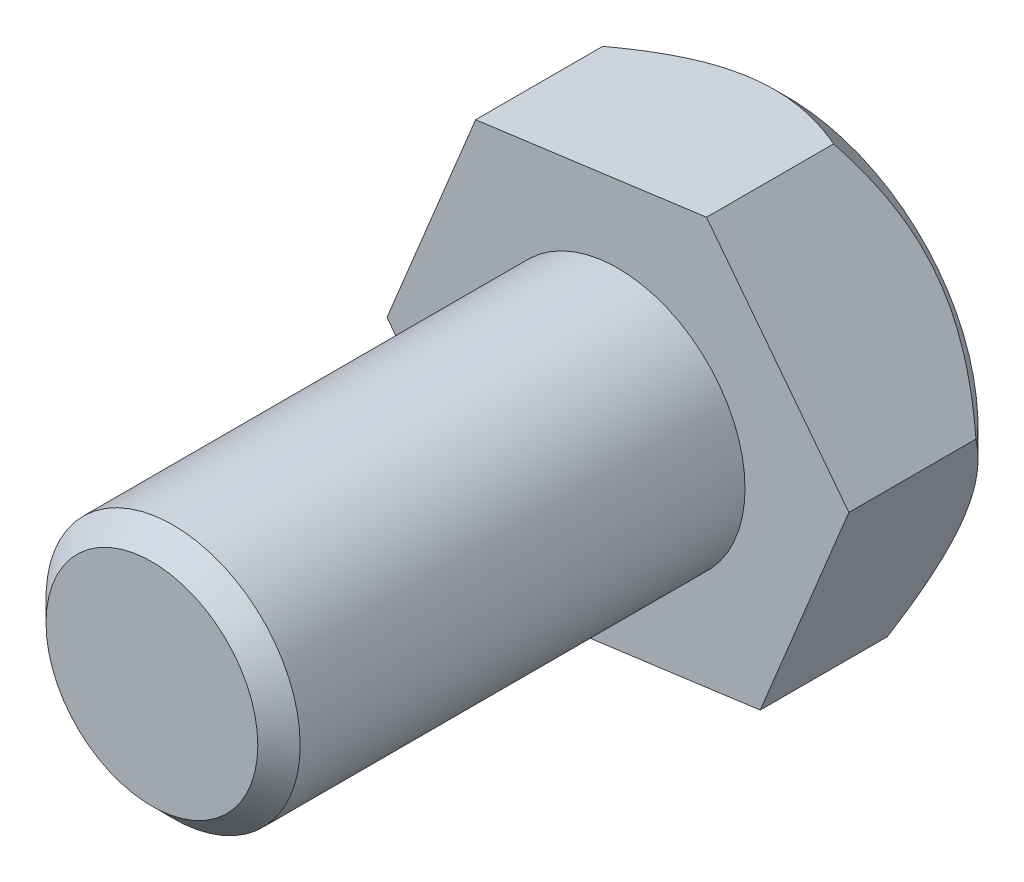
ISO-10303-21;
HEADER;
FILE_DESCRIPTION(('STEP AP214'),'2;1');
FILE_NAME('part.step','',(''),(''),'','','');
FILE_SCHEMA(('AUTOMOTIVE_DESIGN { 1 0 10303 214 1 1 1 1 }'));
ENDSEC;
DATA;
#1=APPLICATION_CONTEXT('core data for automotive mechanical design processes');
#2=APPLICATION_PROTOCOL_DEFINITION('international standard','automotive_design',2000,#1);
#3=PRODUCT_CONTEXT('',#1,'mechanical');
#4=PRODUCT('Part','Part','',(#3));
#5=PRODUCT_RELATED_PRODUCT_CATEGORY('part','',(#4));
#6=PRODUCT_DEFINITION_FORMATION('','',#4);
#7=PRODUCT_DEFINITION_CONTEXT('part definition',#1,'design');
#8=PRODUCT_DEFINITION('design','',#6,#7);
#9=PRODUCT_DEFINITION_SHAPE('','',#8);
#10=(LENGTH_UNIT() NAMED_UNIT(*) SI_UNIT(.MILLI.,.METRE.));
#11=(NAMED_UNIT(*) PLANE_ANGLE_UNIT() SI_UNIT($,.RADIAN.));
#12=(NAMED_UNIT(*) SI_UNIT($,.STERADIAN.) SOLID_ANGLE_UNIT());
#13=UNCERTAINTY_MEASURE_WITH_UNIT(LENGTH_MEASURE(1.E-05),#10,'distance_accuracy_value','');
#14=(GEOMETRIC_REPRESENTATION_CONTEXT(3) GLOBAL_UNCERTAINTY_ASSIGNED_CONTEXT((#13)) GLOBAL_UNIT_ASSIGNED_CONTEXT((#10,
#11,#12)) REPRESENTATION_CONTEXT('',''));
#15=CARTESIAN_POINT('',(0.,0.,0.));
#16=DIRECTION('',(0.,0.,1.));
#17=DIRECTION('',(1.,0.,0.));
#18=AXIS2_PLACEMENT_3D('',#15,#16,#17);
#19=CARTESIAN_POINT('',(0.,0.,0.));
#20=DIRECTION('',(0.,0.,1.));
#21=DIRECTION('',(1.,0.,0.));
#22=AXIS2_PLACEMENT_3D('',#19,#20,#21);
#23=PLANE('',#22);
#24=CARTESIAN_POINT('',(0.,0.,0.));
#25=DIRECTION('',(0.,0.,1.));
#26=DIRECTION('',(1.,0.,0.));
#27=AXIS2_PLACEMENT_3D('',#24,#25,#26);
#28=CIRCLE('',#27,4.5);
#29=CARTESIAN_POINT('',(1.7113581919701,4.16188096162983,0.));
#30=VERTEX_POINT('',#29);
#31=EDGE_CURVE('E46',#30,#30,#28,.F.);
#32=ORIENTED_EDGE('',*,*,#31,.T.);
#33=EDGE_LOOP('',(#32));
#34=FACE_BOUND('',#33,.T.);
#35=ADVANCED_FACE('F33',(#34),#23,.F.);
#36=CARTESIAN_POINT('',(0.,0.,4.));
#37=DIRECTION('',(0.,0.,1.));
#38=DIRECTION('',(1.,0.,0.));
#39=AXIS2_PLACEMENT_3D('',#36,#37,#38);
#40=PLANE('',#39);
#41=DIRECTION('',(-0.380301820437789,-0.924862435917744,0.));
#42=VECTOR('',#41,1.);
#43=CARTESIAN_POINT('',(4.40524900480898,-1.81143070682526,4.));
#44=LINE('',#43,#42);
#45=CARTESIAN_POINT('',(5.4510790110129,0.731940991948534,4.));
#46=VERTEX_POINT('',#45);
#47=CARTESIAN_POINT('',(3.35941899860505,-4.35480240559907,4.));
#48=VERTEX_POINT('',#47);
#49=EDGE_CURVE('E97',#46,#48,#44,.T.);
#50=ORIENTED_EDGE('',*,*,#49,.F.);
#51=DIRECTION('',(0.61080345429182,-0.791782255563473,0.));
#52=VECTOR('',#51,1.);
#53=CARTESIAN_POINT('',(3.7713695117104,2.90934219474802,4.));
#54=LINE('',#53,#52);
#55=CARTESIAN_POINT('',(2.09166001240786,5.08674339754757,4.));
#56=VERTEX_POINT('',#55);
#57=EDGE_CURVE('E169',#56,#46,#54,.T.);
#58=ORIENTED_EDGE('',*,*,#57,.F.);
#59=DIRECTION('',(0.99110527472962,0.133080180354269,0.));
#60=VECTOR('',#59,1.);
#61=CARTESIAN_POINT('',(-0.633879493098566,4.72077290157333,4.));
#62=LINE('',#61,#60);
#63=CARTESIAN_POINT('',(-3.35941899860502,4.35480240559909,4.));
#64=VERTEX_POINT('',#63);
#65=EDGE_CURVE('E155',#64,#56,#62,.T.);
#66=ORIENTED_EDGE('',*,*,#65,.F.);
#67=DIRECTION('',(0.380301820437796,0.924862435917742,0.));
#68=VECTOR('',#67,1.);
#69=CARTESIAN_POINT('',(-4.40524900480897,1.81143070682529,4.));
#70=LINE('',#69,#68);
#71=CARTESIAN_POINT('',(-5.45107901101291,-0.731940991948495,4.));
#72=VERTEX_POINT('',#71);
#73=EDGE_CURVE('E151',#72,#64,#70,.T.);
#74=ORIENTED_EDGE('',*,*,#73,.F.);
#75=DIRECTION('',(-0.61080345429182,0.791782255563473,0.));
#76=VECTOR('',#75,1.);
#77=CARTESIAN_POINT('',(-3.7713695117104,-2.90934219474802,4.));
#78=LINE('',#77,#76);
#79=CARTESIAN_POINT('',(-2.0916600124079,-5.08674339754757,4.));
#80=VERTEX_POINT('',#79);
#81=EDGE_CURVE('E141',#80,#72,#78,.T.);
#82=ORIENTED_EDGE('',*,*,#81,.F.);
#83=DIRECTION('',(-0.991105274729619,-0.133080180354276,0.));
#84=VECTOR('',#83,1.);
#85=CARTESIAN_POINT('',(0.633879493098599,-4.72077290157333,4.));
#86=LINE('',#85,#84);
#87=EDGE_CURVE('E114',#48,#80,#86,.T.);
#88=ORIENTED_EDGE('',*,*,#87,.F.);
#89=EDGE_LOOP('',(#50,#58,#66,#74,#82,#88));
#90=FACE_BOUND('',#89,.T.);
#91=CARTESIAN_POINT('',(0.,0.,4.));
#92=DIRECTION('',(0.,0.,1.));
#93=DIRECTION('',(1.,0.,0.));
#94=AXIS2_PLACEMENT_3D('',#91,#92,#93);
#95=CIRCLE('',#94,3.);
#96=CARTESIAN_POINT('',(3.,0.,4.));
#97=VERTEX_POINT('',#96);
#98=EDGE_CURVE('E159',#97,#97,#95,.T.);
#99=ORIENTED_EDGE('',*,*,#98,.F.);
#100=EDGE_LOOP('',(#99));
#101=FACE_BOUND('',#100,.T.);
#102=ADVANCED_FACE('F188',(#90,#101),#40,.T.);
#103=CARTESIAN_POINT('',(0.,0.,4.));
#104=DIRECTION('',(0.,0.,1.));
#105=DIRECTION('',(1.,0.,0.));
#106=AXIS2_PLACEMENT_3D('',#103,#104,#105);
#107=CYLINDRICAL_SURFACE('',#106,3.);
#108=CARTESIAN_POINT('',(0.,0.,14.5));
#109=DIRECTION('',(0.,0.,1.));
#110=DIRECTION('',(1.,0.,0.));
#111=AXIS2_PLACEMENT_3D('',#108,#109,#110);
#112=CIRCLE('',#111,3.);
#113=CARTESIAN_POINT('',(3.,0.,14.5));
#114=VERTEX_POINT('',#113);
#115=EDGE_CURVE('E166',#114,#114,#112,.F.);
#116=ORIENTED_EDGE('',*,*,#115,.T.);
#117=EDGE_LOOP('',(#116));
#118=FACE_BOUND('',#117,.T.);
#119=ORIENTED_EDGE('',*,*,#98,.T.);
#120=EDGE_LOOP('',(#119));
#121=FACE_BOUND('',#120,.T.);
#122=ADVANCED_FACE('F184',(#118,#121),#107,.T.);
#123=CARTESIAN_POINT('',(0.,0.,15.));
#124=DIRECTION('',(0.,0.,1.));
#125=DIRECTION('',(1.,0.,0.));
#126=AXIS2_PLACEMENT_3D('',#123,#124,#125);
#127=PLANE('',#126);
#128=CARTESIAN_POINT('',(0.,0.,15.));
#129=DIRECTION('',(0.,0.,1.));
#130=DIRECTION('',(1.,0.,0.));
#131=AXIS2_PLACEMENT_3D('',#128,#129,#130);
#132=CIRCLE('',#131,2.5);
#133=CARTESIAN_POINT('',(2.5,0.,15.));
#134=VERTEX_POINT('',#133);
#135=EDGE_CURVE('E163',#134,#134,#132,.T.);
#136=ORIENTED_EDGE('',*,*,#135,.T.);
#137=EDGE_LOOP('',(#136));
#138=FACE_BOUND('',#137,.T.);
#139=ADVANCED_FACE('F187',(#138),#127,.T.);
#140=CARTESIAN_POINT('',(0.,0.,15.));
#141=DIRECTION('',(0.,0.,-1.));
#142=DIRECTION('',(-1.,0.,0.));
#143=AXIS2_PLACEMENT_3D('',#140,#141,#142);
#144=CONICAL_SURFACE('',#143,2.5,0.785398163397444);
#145=ORIENTED_EDGE('',*,*,#115,.F.);
#146=EDGE_LOOP('',(#145));
#147=FACE_BOUND('',#146,.T.);
#148=ORIENTED_EDGE('',*,*,#135,.F.);
#149=EDGE_LOOP('',(#148));
#150=FACE_BOUND('',#149,.T.);
#151=ADVANCED_FACE('F180',(#147,#150),#144,.T.);
#152=CARTESIAN_POINT('',(5.45107901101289,0.731940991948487,6.));
#153=DIRECTION('',(-0.791782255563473,-0.61080345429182,0.));
#154=DIRECTION('',(0.61080345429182,-0.791782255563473,0.));
#155=AXIS2_PLACEMENT_3D('',#152,#153,#154);
#156=PLANE('',#155);
#157=DIRECTION('',(0.,0.,-1.));
#158=VECTOR('',#157,1.);
#159=CARTESIAN_POINT('',(5.45107901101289,0.731940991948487,6.));
#160=LINE('',#159,#158);
#161=CARTESIAN_POINT('',(5.4510790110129,0.731940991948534,0.999999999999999));
#162=VERTEX_POINT('',#161);
#163=EDGE_CURVE('E157',#46,#162,#160,.T.);
#164=ORIENTED_EDGE('',*,*,#163,.T.);
#165=CARTESIAN_POINT('',(5.4510790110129,0.731940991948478,0.999999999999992));
#166=CARTESIAN_POINT('',(5.39305388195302,0.807158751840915,0.952508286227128));
#167=CARTESIAN_POINT('',(5.33458087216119,0.882957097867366,0.906480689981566));
#168=CARTESIAN_POINT('',(5.21665010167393,1.03583031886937,0.817801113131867));
#169=CARTESIAN_POINT('',(5.15719181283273,1.11290587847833,0.775151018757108));
#170=CARTESIAN_POINT('',(4.97666052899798,1.34692791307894,0.652579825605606));
#171=CARTESIAN_POINT('',(4.85405159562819,1.50586541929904,0.578557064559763));
#172=CARTESIAN_POINT('',(4.60791532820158,1.82493095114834,0.452544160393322));
#173=CARTESIAN_POINT('',(4.48448694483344,1.9849307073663,0.400051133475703));
#174=CARTESIAN_POINT('',(4.29732904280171,2.22754280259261,0.339313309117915));
#175=CARTESIAN_POINT('',(4.23466921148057,2.30876850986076,0.322075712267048));
#176=CARTESIAN_POINT('',(4.10882255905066,2.47190305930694,0.293987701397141));
#177=CARTESIAN_POINT('',(4.04563581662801,2.55381179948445,0.283136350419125));
#178=CARTESIAN_POINT('',(3.89145948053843,2.7536700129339,0.264892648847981));
#179=CARTESIAN_POINT('',(3.80030328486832,2.87183545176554,0.261044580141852));
#180=CARTESIAN_POINT('',(3.61815363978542,3.10795536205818,0.26740761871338));
#181=CARTESIAN_POINT('',(3.52716025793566,3.2259097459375,0.277623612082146));
#182=CARTESIAN_POINT('',(3.3455684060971,3.46130659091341,0.311602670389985));
#183=CARTESIAN_POINT('',(3.25497579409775,3.57874145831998,0.335448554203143));
#184=CARTESIAN_POINT('',(3.07536112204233,3.81157529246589,0.395427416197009));
#185=CARTESIAN_POINT('',(2.98633888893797,3.9269744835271,0.431559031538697));
#186=CARTESIAN_POINT('',(2.76242505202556,4.21723316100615,0.536931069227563));
#187=CARTESIAN_POINT('',(2.6288238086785,4.39041995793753,0.613502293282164));
#188=CARTESIAN_POINT('',(2.36618328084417,4.73087990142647,0.785930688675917));
#189=CARTESIAN_POINT('',(2.23715325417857,4.89814104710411,0.881824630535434));
#190=CARTESIAN_POINT('',(2.0474073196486,5.14410799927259,1.03586186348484));
#191=CARTESIAN_POINT('',(1.98503950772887,5.22495516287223,1.08867029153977));
#192=CARTESIAN_POINT('',(1.86128598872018,5.38537639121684,1.19731019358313));
#193=CARTESIAN_POINT('',(1.79990035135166,5.46495036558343,1.25314188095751));
#194=CARTESIAN_POINT('',(1.67832843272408,5.622543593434,1.36712479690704));
#195=CARTESIAN_POINT('',(1.6181378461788,5.70056842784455,1.42526377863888));
#196=CARTESIAN_POINT('',(1.4985964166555,5.85552954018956,1.54375592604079));
#197=CARTESIAN_POINT('',(1.43924535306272,5.93246610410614,1.60410849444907));
#198=CARTESIAN_POINT('',(1.38026684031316,6.00891973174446,1.66540776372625));
#199=B_SPLINE_CURVE_WITH_KNOTS('',3,(#165,#166,#167,#168,#169,#170,#171,#172,#173,#174,#175,
#176,#177,#178,#179,#180,#181,#182,#183,#184,#185,#186,#187,#188,#189,#190,#191,#192,#193,#194,
#195,#196,#197,#198),.UNSPECIFIED.,.F.,.F.,(4,2,2,2,2,2,2,2,2,2,2,2,2,2,2,2,4),(0.,
0.318604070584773,0.637384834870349,1.27836026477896,1.9033695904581,2.21526711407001,
2.52711886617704,2.97429390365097,3.42162433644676,3.8717022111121,4.32173017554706,
5.01567358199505,5.71095022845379,6.05577681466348,6.40062777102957,6.74384439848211,
7.08696909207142),.UNSPECIFIED.);
#200=CARTESIAN_POINT('',(2.0916600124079,5.08674339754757,0.999999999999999));
#201=VERTEX_POINT('',#200);
#202=EDGE_CURVE('E108',#162,#201,#199,.T.);
#203=ORIENTED_EDGE('',*,*,#202,.T.);
#204=DIRECTION('',(0.,0.,-1.));
#205=VECTOR('',#204,1.);
#206=CARTESIAN_POINT('',(2.0916600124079,5.08674339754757,6.));
#207=LINE('',#206,#205);
#208=EDGE_CURVE('E56',#56,#201,#207,.T.);
#209=ORIENTED_EDGE('',*,*,#208,.F.);
#210=ORIENTED_EDGE('',*,*,#57,.T.);
#211=EDGE_LOOP('',(#164,#203,#209,#210));
#212=FACE_BOUND('',#211,.T.);
#213=ADVANCED_FACE('F176',(#212),#156,.F.);
#214=CARTESIAN_POINT('',(0.,0.,1.));
#215=DIRECTION('',(0.,0.,1.));
#216=DIRECTION('',(1.,0.,0.));
#217=AXIS2_PLACEMENT_3D('',#214,#215,#216);
#218=CONICAL_SURFACE('',#217,5.5,0.785398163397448);
#219=CARTESIAN_POINT('',(3.35933675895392,-4.35500240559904,1.00010812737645));
#220=CARTESIAN_POINT('',(3.39530187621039,-4.26753822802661,0.952827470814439));
#221=CARTESIAN_POINT('',(3.43154344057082,-4.17940175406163,0.906997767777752));
#222=CARTESIAN_POINT('',(3.50463370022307,-4.00165231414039,0.818681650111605));
#223=CARTESIAN_POINT('',(3.5414827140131,-3.91203857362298,0.776197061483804));
#224=CARTESIAN_POINT('',(3.6533646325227,-3.63995104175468,0.654060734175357));
#225=CARTESIAN_POINT('',(3.72934468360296,-3.45517386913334,0.580247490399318));
#226=CARTESIAN_POINT('',(3.88256454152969,-3.0825559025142,0.453847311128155));
#227=CARTESIAN_POINT('',(3.95976518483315,-2.89481035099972,0.400941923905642));
#228=CARTESIAN_POINT('',(4.07683538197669,-2.6101053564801,0.339743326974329));
#229=CARTESIAN_POINT('',(4.11603114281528,-2.51478452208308,0.322378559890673));
#230=CARTESIAN_POINT('',(4.19475454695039,-2.32333574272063,0.294095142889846));
#231=CARTESIAN_POINT('',(4.23428213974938,-2.22720792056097,0.283175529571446));
#232=CARTESIAN_POINT('',(4.33060471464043,-1.99295941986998,0.264867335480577));
#233=CARTESIAN_POINT('',(4.38750347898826,-1.85458635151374,0.261025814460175));
#234=CARTESIAN_POINT('',(4.50119846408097,-1.5780895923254,0.267472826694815));
#235=CARTESIAN_POINT('',(4.55799464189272,-1.43996600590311,0.277766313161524));
#236=CARTESIAN_POINT('',(4.6710515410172,-1.16502101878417,0.311876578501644));
#237=CARTESIAN_POINT('',(4.72731159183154,-1.02820124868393,0.335708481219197));
#238=CARTESIAN_POINT('',(4.83886472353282,-0.756913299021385,0.395599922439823));
#239=CARTESIAN_POINT('',(4.89415787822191,-0.622444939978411,0.431658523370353));
#240=CARTESIAN_POINT('',(4.99231452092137,-0.383736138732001,0.505843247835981));
#241=CARTESIAN_POINT('',(5.03539533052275,-0.278967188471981,0.542018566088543));
#242=CARTESIAN_POINT('',(5.12078357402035,-0.0713100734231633,0.620198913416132));
#243=CARTESIAN_POINT('',(5.16309098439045,0.0315780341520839,0.662204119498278));
#244=CARTESIAN_POINT('',(5.24679917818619,0.23514940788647,0.751102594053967));
#245=CARTESIAN_POINT('',(5.28820234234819,0.335838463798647,0.797980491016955));
#246=CARTESIAN_POINT('',(5.370241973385,0.535352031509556,0.896008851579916));
#247=CARTESIAN_POINT('',(5.41087889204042,0.63417764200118,0.947156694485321));
#248=CARTESIAN_POINT('',(5.45116125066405,0.732140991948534,1.00010812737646));
#249=B_SPLINE_CURVE_WITH_KNOTS('',3,(#219,#220,#221,#222,#223,#224,#225,#226,#227,#228,#229,
#230,#231,#232,#233,#234,#235,#236,#237,#238,#239,#240,#241,#242,#243,#244,#245,#246,#247,#248),
.UNSPECIFIED.,.F.,.F.,(4,2,2,2,2,2,2,2,2,2,2,2,2,2,4),(0.,0.317172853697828,0.6345176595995,
1.27263354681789,1.90061643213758,2.21399197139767,2.52732065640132,2.97561522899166,
3.42406693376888,3.87302059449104,4.32193983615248,4.67852205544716,5.03511510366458,
5.39061554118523,5.74589937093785),.UNSPECIFIED.);
#250=CARTESIAN_POINT('',(3.35941899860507,-4.35480240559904,1.));
#251=VERTEX_POINT('',#250);
#252=EDGE_CURVE('E94',#251,#162,#249,.T.);
#253=ORIENTED_EDGE('',*,*,#252,.F.);
#254=CARTESIAN_POINT('',(-2.09186001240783,-5.08677025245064,1.00010090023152));
#255=CARTESIAN_POINT('',(-1.99813168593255,-5.07418492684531,0.95282064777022));
#256=CARTESIAN_POINT('',(-1.90368291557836,-5.06150286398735,0.90699134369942));
#257=CARTESIAN_POINT('',(-1.71320314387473,-5.03592628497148,0.818676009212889));
#258=CARTESIAN_POINT('',(-1.61717131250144,-5.02303165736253,0.776191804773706));
#259=CARTESIAN_POINT('',(-1.32559703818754,-4.98388066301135,0.654056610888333));
#260=CARTESIAN_POINT('',(-1.12758626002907,-4.95729286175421,0.580244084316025));
#261=CARTESIAN_POINT('',(-0.728281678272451,-4.90367643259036,0.453845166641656));
#262=CARTESIAN_POINT('',(-0.527089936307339,-4.87666150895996,0.400940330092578));
#263=CARTESIAN_POINT('',(-0.221994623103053,-4.83569498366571,0.339742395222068));
#264=CARTESIAN_POINT('',(-0.119846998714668,-4.82197916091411,0.322377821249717));
#265=CARTESIAN_POINT('',(0.0853131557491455,-4.79443138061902,0.294094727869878));
#266=CARTESIAN_POINT('',(0.188325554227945,-4.78059944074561,0.283175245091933));
#267=CARTESIAN_POINT('',(0.439351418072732,-4.74689306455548,0.264867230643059));
#268=CARTESIAN_POINT('',(0.587635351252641,-4.72698231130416,0.261025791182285));
#269=CARTESIAN_POINT('',(0.88393597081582,-4.6871966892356,0.267472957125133));
#270=CARTESIAN_POINT('',(1.03195254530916,-4.66732183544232,0.277766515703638));
#271=CARTESIAN_POINT('',(1.32659023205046,-4.62775950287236,0.3118769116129));
#272=CARTESIAN_POINT('',(1.47320959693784,-4.60807225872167,0.335708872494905));
#273=CARTESIAN_POINT('',(1.76392830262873,-4.56903614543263,0.395600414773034));
#274=CARTESIAN_POINT('',(1.90802783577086,-4.54968725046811,0.431659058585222));
#275=CARTESIAN_POINT('',(2.16383252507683,-4.51533919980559,0.505843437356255));
#276=CARTESIAN_POINT('',(2.27610406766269,-4.50026399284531,0.542018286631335));
#277=CARTESIAN_POINT('',(2.49863170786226,-4.47038420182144,0.620197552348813));
#278=CARTESIAN_POINT('',(2.60888774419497,-4.45557962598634,0.662202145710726));
#279=CARTESIAN_POINT('',(2.82703710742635,-4.42628772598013,0.751099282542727));
#280=CARTESIAN_POINT('',(2.9349366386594,-4.41179956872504,0.797976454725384));
#281=CARTESIAN_POINT('',(3.14873766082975,-4.38309154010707,0.896003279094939));
#282=CARTESIAN_POINT('',(3.25464032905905,-4.36887151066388,0.947150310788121));
#283=CARTESIAN_POINT('',(3.35961899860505,-4.35477555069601,1.00010090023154));
#284=B_SPLINE_CURVE_WITH_KNOTS('',3,(#254,#255,#256,#257,#258,#259,#260,#261,#262,#263,#264,
#265,#266,#267,#268,#269,#270,#271,#272,#273,#274,#275,#276,#277,#278,#279,#280,#281,#282,#283),
.UNSPECIFIED.,.F.,.F.,(4,2,2,2,2,2,2,2,2,2,2,2,2,2,4),(0.,0.317171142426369,0.634514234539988,
1.27262662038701,1.90060618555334,2.21398007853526,2.52730711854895,2.97560155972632,
3.42405313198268,3.873006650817,4.32192575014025,4.67850341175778,5.035091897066,
5.39058777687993,5.74586706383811),.UNSPECIFIED.);
#285=CARTESIAN_POINT('',(-2.09166001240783,-5.08674339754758,1.00000000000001));
#286=VERTEX_POINT('',#285);
#287=EDGE_CURVE('E101',#286,#251,#284,.T.);
#288=ORIENTED_EDGE('',*,*,#287,.F.);
#289=CARTESIAN_POINT('',(-5.45123329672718,-0.731740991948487,1.00012630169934));
#290=CARTESIAN_POINT('',(-5.3934689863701,-0.806620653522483,0.952844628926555));
#291=CARTESIAN_POINT('',(-5.33526066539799,-0.882075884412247,0.907013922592));
#292=CARTESIAN_POINT('',(-5.21786888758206,-1.03425041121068,0.818695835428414));
#293=CARTESIAN_POINT('',(-5.1586849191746,-1.11097037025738,0.776210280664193));
#294=CARTESIAN_POINT('',(-4.97898899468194,-1.34390953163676,0.654071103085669));
#295=CARTESIAN_POINT('',(-4.85695578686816,-1.50210072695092,0.580256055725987));
#296=CARTESIAN_POINT('',(-4.61086603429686,-1.82110596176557,0.453852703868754));
#297=CARTESIAN_POINT('',(-4.48687239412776,-1.98183845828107,0.400945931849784));
#298=CARTESIAN_POINT('',(-4.29884334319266,-2.22557982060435,0.33974567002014));
#299=CARTESIAN_POINT('',(-4.23589015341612,-2.30718580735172,0.322380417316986));
#300=CARTESIAN_POINT('',(-4.1094507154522,-2.47108878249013,0.29409618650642));
#301=CARTESIAN_POINT('',(-4.04596454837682,-2.55338566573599,0.283176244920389));
#302=CARTESIAN_POINT('',(-3.89125979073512,-2.75392887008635,0.264867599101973));
#303=CARTESIAN_POINT('',(-3.79987451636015,-2.87239126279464,0.261025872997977));
#304=CARTESIAN_POINT('',(-3.61726865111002,-3.10910256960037,0.267472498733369));
#305=CARTESIAN_POINT('',(-3.526048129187,-3.2273513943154,0.277765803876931));
#306=CARTESIAN_POINT('',(-3.34446707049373,-3.46273424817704,0.311875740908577));
#307=CARTESIAN_POINT('',(-3.25410761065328,-3.57986688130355,0.33570749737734));
#308=CARTESIAN_POINT('',(-3.07494174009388,-3.8121189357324,0.395598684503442));
#309=CARTESIAN_POINT('',(-2.98613521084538,-3.92723851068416,0.43165717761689));
#310=CARTESIAN_POINT('',(-2.82848329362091,-4.13160210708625,0.505842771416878));
#311=CARTESIAN_POINT('',(-2.75928890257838,-4.22129853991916,0.542019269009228));
#312=CARTESIAN_POINT('',(-2.62214231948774,-4.39908114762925,0.620202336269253));
#313=CARTESIAN_POINT('',(-2.55419016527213,-4.4871672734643,0.662209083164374));
#314=CARTESIAN_POINT('',(-2.41974207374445,-4.66145183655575,0.751110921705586));
#315=CARTESIAN_POINT('',(-2.35324231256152,-4.74765523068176,0.797990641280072));
#316=CARTESIAN_POINT('',(-2.22147426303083,-4.91846566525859,0.896022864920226));
#317=CARTESIAN_POINT('',(-2.15620524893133,-5.00307364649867,0.947172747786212));
#318=CARTESIAN_POINT('',(-2.09150572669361,-5.08694339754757,1.00012630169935));
#319=B_SPLINE_CURVE_WITH_KNOTS('',3,(#289,#290,#291,#292,#293,#294,#295,#296,#297,#298,#299,
#300,#301,#302,#303,#304,#305,#306,#307,#308,#309,#310,#311,#312,#313,#314,#315,#316,#317,#318),
.UNSPECIFIED.,.F.,.F.,(4,2,2,2,2,2,2,2,2,2,2,2,2,2,4),(0.,0.317177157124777,0.634526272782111,
1.27265096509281,1.90064219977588,2.21402187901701,2.5273547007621,2.97564960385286,
3.4241016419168,3.87305565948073,4.3219752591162,4.67856893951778,5.03517346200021,
5.39068536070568,5.745980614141),.UNSPECIFIED.);
#320=CARTESIAN_POINT('',(-5.45107901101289,-0.731940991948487,0.999999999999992));
#321=VERTEX_POINT('',#320);
#322=EDGE_CURVE('E136',#321,#286,#319,.T.);
#323=ORIENTED_EDGE('',*,*,#322,.F.);
#324=CARTESIAN_POINT('',(-3.35933675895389,4.35500240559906,1.00010812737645));
#325=CARTESIAN_POINT('',(-3.39530187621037,4.26753822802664,0.95282747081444));
#326=CARTESIAN_POINT('',(-3.43154344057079,4.17940175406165,0.906997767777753));
#327=CARTESIAN_POINT('',(-3.50463370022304,4.00165231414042,0.818681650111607));
#328=CARTESIAN_POINT('',(-3.54148271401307,3.91203857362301,0.776197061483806));
#329=CARTESIAN_POINT('',(-3.65336463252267,3.63995104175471,0.654060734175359));
#330=CARTESIAN_POINT('',(-3.72934468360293,3.45517386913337,0.580247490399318));
#331=CARTESIAN_POINT('',(-3.88256454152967,3.08255590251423,0.453847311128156));
#332=CARTESIAN_POINT('',(-3.95976518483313,2.89481035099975,0.400941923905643));
#333=CARTESIAN_POINT('',(-4.07683538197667,2.61010535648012,0.339743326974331));
#334=CARTESIAN_POINT('',(-4.11603114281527,2.51478452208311,0.322378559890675));
#335=CARTESIAN_POINT('',(-4.19475454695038,2.32333574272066,0.294095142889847));
#336=CARTESIAN_POINT('',(-4.23428213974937,2.227207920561,0.283175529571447));
#337=CARTESIAN_POINT('',(-4.33060471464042,1.99295941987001,0.264867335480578));
#338=CARTESIAN_POINT('',(-4.38750347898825,1.85458635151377,0.261025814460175));
#339=CARTESIAN_POINT('',(-4.50119846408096,1.57808959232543,0.267472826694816));
#340=CARTESIAN_POINT('',(-4.55799464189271,1.43996600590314,0.277766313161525));
#341=CARTESIAN_POINT('',(-4.67105154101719,1.16502101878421,0.311876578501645));
#342=CARTESIAN_POINT('',(-4.72731159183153,1.02820124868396,0.335708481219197));
#343=CARTESIAN_POINT('',(-4.83886472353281,0.75691329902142,0.395599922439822));
#344=CARTESIAN_POINT('',(-4.8941578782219,0.622444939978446,0.431658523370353));
#345=CARTESIAN_POINT('',(-4.99231452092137,0.383736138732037,0.505843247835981));
#346=CARTESIAN_POINT('',(-5.03539533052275,0.278967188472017,0.542018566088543));
#347=CARTESIAN_POINT('',(-5.12078357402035,0.0713100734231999,0.620198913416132));
#348=CARTESIAN_POINT('',(-5.16309098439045,-0.0315780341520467,0.662204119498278));
#349=CARTESIAN_POINT('',(-5.2467991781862,-0.235149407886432,0.751102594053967));
#350=CARTESIAN_POINT('',(-5.28820234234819,-0.335838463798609,0.797980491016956));
#351=CARTESIAN_POINT('',(-5.370241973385,-0.535352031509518,0.896008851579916));
#352=CARTESIAN_POINT('',(-5.41087889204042,-0.634177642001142,0.947156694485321));
#353=CARTESIAN_POINT('',(-5.45116125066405,-0.732140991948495,1.00010812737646));
#354=B_SPLINE_CURVE_WITH_KNOTS('',3,(#324,#325,#326,#327,#328,#329,#330,#331,#332,#333,#334,
#335,#336,#337,#338,#339,#340,#341,#342,#343,#344,#345,#346,#347,#348,#349,#350,#351,#352,#353),
.UNSPECIFIED.,.F.,.F.,(4,2,2,2,2,2,2,2,2,2,2,2,2,2,4),(0.,0.317172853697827,0.634517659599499,
1.27263354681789,1.90061643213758,2.21399197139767,2.52732065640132,2.97561522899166,
3.42406693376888,3.87302059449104,4.32193983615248,4.67852205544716,5.03511510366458,
5.39061554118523,5.74589937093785),.UNSPECIFIED.);
#355=CARTESIAN_POINT('',(-3.35941899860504,4.35480240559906,1.));
#356=VERTEX_POINT('',#355);
#357=EDGE_CURVE('E145',#356,#321,#354,.T.);
#358=ORIENTED_EDGE('',*,*,#357,.F.);
#359=CARTESIAN_POINT('',(2.09186001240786,5.08677025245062,1.00010090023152));
#360=CARTESIAN_POINT('',(1.99813168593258,5.07418492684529,0.952820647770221));
#361=CARTESIAN_POINT('',(1.90368291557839,5.06150286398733,0.90699134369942));
#362=CARTESIAN_POINT('',(1.71320314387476,5.03592628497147,0.818676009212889));
#363=CARTESIAN_POINT('',(1.61717131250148,5.02303165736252,0.776191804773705));
#364=CARTESIAN_POINT('',(1.32559703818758,4.98388066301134,0.654056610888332));
#365=CARTESIAN_POINT('',(1.12758626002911,4.9572928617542,0.580244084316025));
#366=CARTESIAN_POINT('',(0.728281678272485,4.90367643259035,0.453845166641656));
#367=CARTESIAN_POINT('',(0.527089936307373,4.87666150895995,0.400940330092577));
#368=CARTESIAN_POINT('',(0.221994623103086,4.83569498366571,0.339742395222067));
#369=CARTESIAN_POINT('',(0.119846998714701,4.82197916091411,0.322377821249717));
#370=CARTESIAN_POINT('',(-0.0853131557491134,4.79443138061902,0.294094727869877));
#371=CARTESIAN_POINT('',(-0.188325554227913,4.78059944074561,0.283175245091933));
#372=CARTESIAN_POINT('',(-0.4393514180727,4.74689306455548,0.264867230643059));
#373=CARTESIAN_POINT('',(-0.587635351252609,4.72698231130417,0.261025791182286));
#374=CARTESIAN_POINT('',(-0.88393597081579,4.6871966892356,0.267472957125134));
#375=CARTESIAN_POINT('',(-1.03195254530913,4.66732183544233,0.277766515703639));
#376=CARTESIAN_POINT('',(-1.32659023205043,4.62775950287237,0.311876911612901));
#377=CARTESIAN_POINT('',(-1.47320959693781,4.60807225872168,0.335708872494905));
#378=CARTESIAN_POINT('',(-1.7639283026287,4.56903614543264,0.395600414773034));
#379=CARTESIAN_POINT('',(-1.90802783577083,4.54968725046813,0.431659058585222));
#380=CARTESIAN_POINT('',(-2.1638325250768,4.5153391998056,0.505843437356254));
#381=CARTESIAN_POINT('',(-2.27610406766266,4.50026399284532,0.542018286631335));
#382=CARTESIAN_POINT('',(-2.49863170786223,4.47038420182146,0.620197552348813));
#383=CARTESIAN_POINT('',(-2.60888774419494,4.45557962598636,0.662202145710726));
#384=CARTESIAN_POINT('',(-2.82703710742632,4.42628772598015,0.751099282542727));
#385=CARTESIAN_POINT('',(-2.93493663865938,4.41179956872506,0.797976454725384));
#386=CARTESIAN_POINT('',(-3.14873766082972,4.38309154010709,0.896003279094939));
#387=CARTESIAN_POINT('',(-3.25464032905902,4.3688715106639,0.947150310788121));
#388=CARTESIAN_POINT('',(-3.35961899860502,4.35477555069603,1.00010090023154));
#389=B_SPLINE_CURVE_WITH_KNOTS('',3,(#359,#360,#361,#362,#363,#364,#365,#366,#367,#368,#369,
#370,#371,#372,#373,#374,#375,#376,#377,#378,#379,#380,#381,#382,#383,#384,#385,#386,#387,#388),
.UNSPECIFIED.,.F.,.F.,(4,2,2,2,2,2,2,2,2,2,2,2,2,2,4),(0.,0.317171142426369,0.634514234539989,
1.27262662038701,1.90060618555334,2.21398007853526,2.52730711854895,2.97560155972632,
3.42405313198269,3.87300665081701,4.32192575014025,4.67850341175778,5.035091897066,
5.39058777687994,5.74586706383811),.UNSPECIFIED.);
#390=EDGE_CURVE('E12',#201,#356,#389,.T.);
#391=ORIENTED_EDGE('',*,*,#390,.F.);
#392=ORIENTED_EDGE('',*,*,#202,.F.);
#393=EDGE_LOOP('',(#253,#288,#323,#358,#391,#392));
#394=FACE_BOUND('',#393,.T.);
#395=ORIENTED_EDGE('',*,*,#31,.F.);
#396=EDGE_LOOP('',(#395));
#397=FACE_BOUND('',#396,.T.);
#398=ADVANCED_FACE('F35',(#394,#397),#218,.T.);
#399=CARTESIAN_POINT('',(2.09166001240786,5.08674339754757,6.));
#400=DIRECTION('',(0.133080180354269,-0.99110527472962,0.));
#401=DIRECTION('',(0.99110527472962,0.133080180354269,0.));
#402=AXIS2_PLACEMENT_3D('',#399,#400,#401);
#403=PLANE('',#402);
#404=ORIENTED_EDGE('',*,*,#65,.T.);
#405=ORIENTED_EDGE('',*,*,#208,.T.);
#406=ORIENTED_EDGE('',*,*,#390,.T.);
#407=DIRECTION('',(0.,0.,-1.));
#408=VECTOR('',#407,1.);
#409=CARTESIAN_POINT('',(-3.35941899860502,4.35480240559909,6.));
#410=LINE('',#409,#408);
#411=EDGE_CURVE('E153',#64,#356,#410,.T.);
#412=ORIENTED_EDGE('',*,*,#411,.F.);
#413=EDGE_LOOP('',(#404,#405,#406,#412));
#414=FACE_BOUND('',#413,.T.);
#415=ADVANCED_FACE('F182',(#414),#403,.F.);
#416=CARTESIAN_POINT('',(-3.35941899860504,4.35480240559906,6.));
#417=DIRECTION('',(0.924862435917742,-0.380301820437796,0.));
#418=DIRECTION('',(0.380301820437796,0.924862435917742,0.));
#419=AXIS2_PLACEMENT_3D('',#416,#417,#418);
#420=PLANE('',#419);
#421=ORIENTED_EDGE('',*,*,#73,.T.);
#422=ORIENTED_EDGE('',*,*,#411,.T.);
#423=ORIENTED_EDGE('',*,*,#357,.T.);
#424=DIRECTION('',(0.,0.,-1.));
#425=VECTOR('',#424,1.);
#426=CARTESIAN_POINT('',(-5.45107901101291,-0.731940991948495,6.));
#427=LINE('',#426,#425);
#428=EDGE_CURVE('E143',#72,#321,#427,.T.);
#429=ORIENTED_EDGE('',*,*,#428,.F.);
#430=EDGE_LOOP('',(#421,#422,#423,#429));
#431=FACE_BOUND('',#430,.T.);
#432=ADVANCED_FACE('F132',(#431),#420,.F.);
#433=CARTESIAN_POINT('',(-5.45107901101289,-0.731940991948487,6.));
#434=DIRECTION('',(0.791782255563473,0.61080345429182,0.));
#435=DIRECTION('',(-0.61080345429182,0.791782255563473,0.));
#436=AXIS2_PLACEMENT_3D('',#433,#434,#435);
#437=PLANE('',#436);
#438=ORIENTED_EDGE('',*,*,#81,.T.);
#439=ORIENTED_EDGE('',*,*,#428,.T.);
#440=ORIENTED_EDGE('',*,*,#322,.T.);
#441=DIRECTION('',(0.,0.,-1.));
#442=VECTOR('',#441,1.);
#443=CARTESIAN_POINT('',(-2.0916600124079,-5.08674339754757,6.));
#444=LINE('',#443,#442);
#445=EDGE_CURVE('E113',#80,#286,#444,.T.);
#446=ORIENTED_EDGE('',*,*,#445,.F.);
#447=EDGE_LOOP('',(#438,#439,#440,#446));
#448=FACE_BOUND('',#447,.T.);
#449=ADVANCED_FACE('F127',(#448),#437,.F.);
#450=CARTESIAN_POINT('',(-2.09166001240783,-5.08674339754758,6.));
#451=DIRECTION('',(-0.133080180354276,0.991105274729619,0.));
#452=DIRECTION('',(-0.991105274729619,-0.133080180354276,0.));
#453=AXIS2_PLACEMENT_3D('',#450,#451,#452);
#454=PLANE('',#453);
#455=ORIENTED_EDGE('',*,*,#87,.T.);
#456=ORIENTED_EDGE('',*,*,#445,.T.);
#457=ORIENTED_EDGE('',*,*,#287,.T.);
#458=DIRECTION('',(0.,0.,-1.));
#459=VECTOR('',#458,1.);
#460=CARTESIAN_POINT('',(3.35941899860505,-4.35480240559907,6.));
#461=LINE('',#460,#459);
#462=EDGE_CURVE('E91',#48,#251,#461,.T.);
#463=ORIENTED_EDGE('',*,*,#462,.F.);
#464=EDGE_LOOP('',(#455,#456,#457,#463));
#465=FACE_BOUND('',#464,.T.);
#466=ADVANCED_FACE('F111',(#465),#454,.F.);
#467=CARTESIAN_POINT('',(3.35941899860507,-4.35480240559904,6.));
#468=DIRECTION('',(-0.924862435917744,0.380301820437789,0.));
#469=DIRECTION('',(-0.380301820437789,-0.924862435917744,0.));
#470=AXIS2_PLACEMENT_3D('',#467,#468,#469);
#471=PLANE('',#470);
#472=ORIENTED_EDGE('',*,*,#49,.T.);
#473=ORIENTED_EDGE('',*,*,#462,.T.);
#474=ORIENTED_EDGE('',*,*,#252,.T.);
#475=ORIENTED_EDGE('',*,*,#163,.F.);
#476=EDGE_LOOP('',(#472,#473,#474,#475));
#477=FACE_BOUND('',#476,.T.);
#478=ADVANCED_FACE('F93',(#477),#471,.F.);
#479=CLOSED_SHELL('',(#35,#102,#122,#139,#151,#213,#398,#415,#432,#449,#466,#478));
#480=MANIFOLD_SOLID_BREP('B2',#479);
#481=ADVANCED_BREP_SHAPE_REPRESENTATION('',(#18,#480),#14);
#482=SHAPE_DEFINITION_REPRESENTATION(#9,#481);
ENDSEC;
END-ISO-10303-21;
